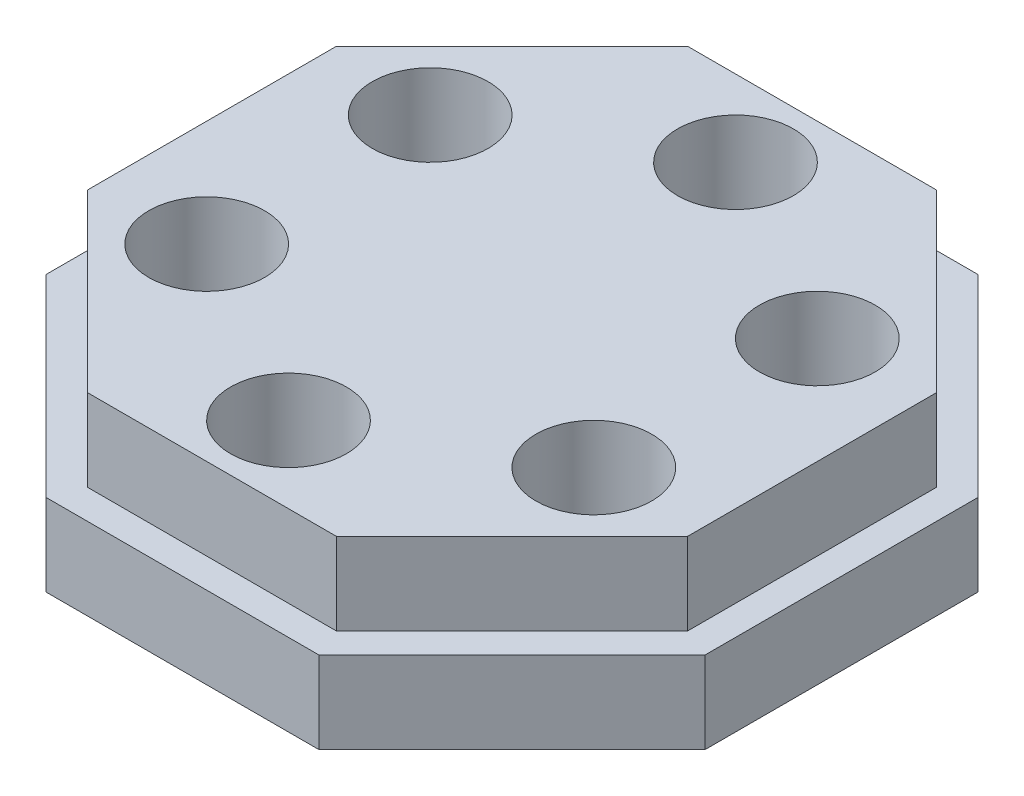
from build123d import *

# Parameters (mm, degrees)
BOSS_EXTRUDE1_DEPTH = 19.05
BOSS_EXTRUDE2_DEPTH = 19.05
SKETCH3_R           = 13.462
CUT_EXTRUDE1_DEPTH  = 115.808140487


with BuildPart() as part:
    # Sketch1 → Boss-Extrude1 (new body)
    with BuildSketch(Plane(origin=(0, 0, 0), x_dir=(1, 0, 0), z_dir=(0, 1, 0))):
        Polygon((-31.72088882, 76.581), (31.72088882, 76.581), (76.581, 31.72088882), (76.581, -31.72088882), (31.72088882, -76.581), (-31.72088882, -76.581), (-76.581, -31.72088882), (-76.581, 31.72088882), align=None)
    extrude(amount=BOSS_EXTRUDE1_DEPTH)

    # Sketch2 → Boss-Extrude2 (add)
    with BuildSketch(Plane(origin=(0, 19.05, 0), x_dir=(1, 0, 0), z_dir=(0, 1, 0))):
        Polygon((-28.880212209, 69.723), (28.880212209, 69.723), (69.723, 28.880212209), (69.723, -28.880212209), (28.880212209, -69.723), (-28.880212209, -69.723), (-69.723, -28.880212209), (-69.723, 28.880212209), align=None)
    extrude(amount=BOSS_EXTRUDE2_DEPTH)

    # Sketch3 → Cut-Extrude1 (cut, through all)
    with BuildSketch(Plane(origin=(0, 38.1, 0), x_dir=(1, 0, 0), z_dir=(0, 1, 0))):
        with Locations(Location((0, 51.943, 0), (0, 0, 270))):
            Circle(SKETCH3_R)
        with Locations(Location((44.983957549, 25.9715, 0), (0, 0, 270))):
            Circle(SKETCH3_R)
        with Locations(Location((44.983957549, -25.9715, 0), (0, 0, 270))):
            Circle(SKETCH3_R)
        with Locations(Location((0, -51.943, 0), (0, 0, 270))):
            Circle(SKETCH3_R)
        with Locations(Location((-44.983957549, -25.9715, 0), (0, 0, 270))):
            Circle(SKETCH3_R)
        with Locations(Location((-44.983957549, 25.9715, 0), (0, 0, 270))):
            Circle(SKETCH3_R)
    extrude(amount=-CUT_EXTRUDE1_DEPTH, mode=Mode.SUBTRACT)


solid = part.part
